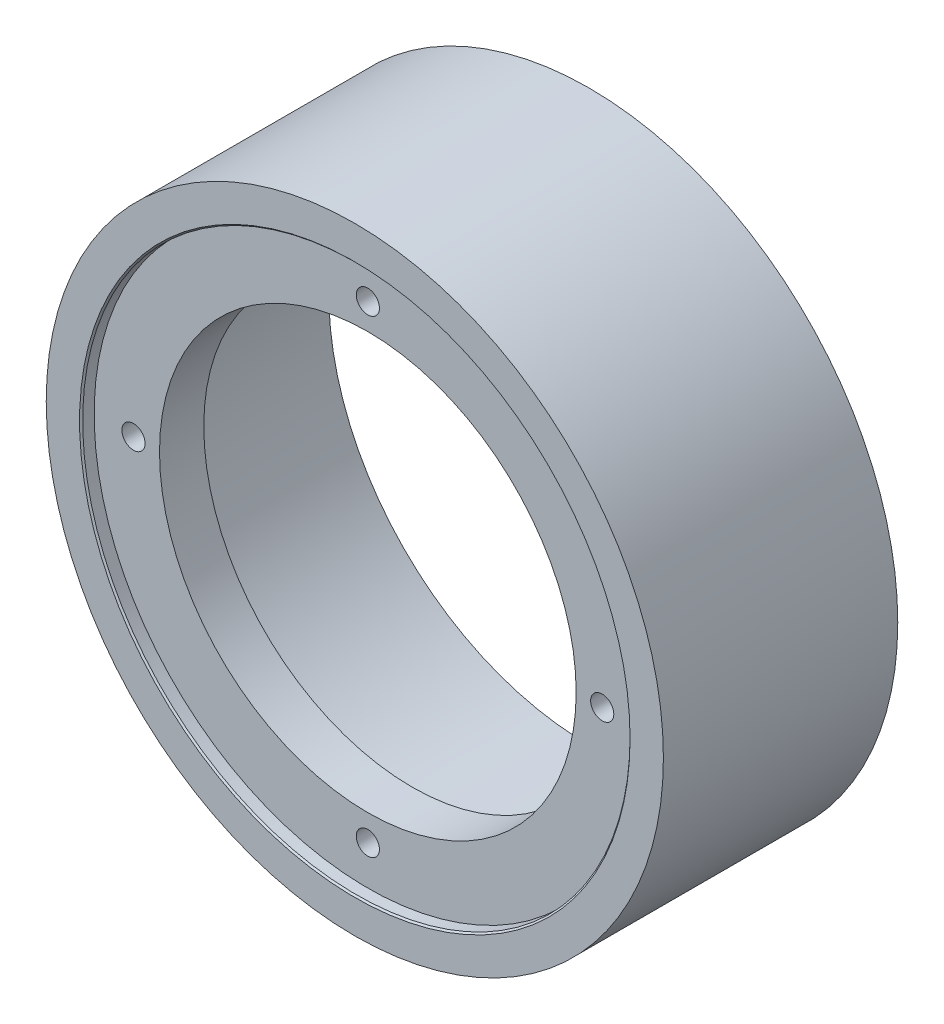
ISO-10303-21;
HEADER;
FILE_DESCRIPTION(('STEP AP214'),'2;1');
FILE_NAME('part.step','',(''),(''),'','','');
FILE_SCHEMA(('AUTOMOTIVE_DESIGN { 1 0 10303 214 1 1 1 1 }'));
ENDSEC;
DATA;
#1=APPLICATION_CONTEXT('core data for automotive mechanical design processes');
#2=APPLICATION_PROTOCOL_DEFINITION('international standard','automotive_design',2000,#1);
#3=PRODUCT_CONTEXT('',#1,'mechanical');
#4=PRODUCT('Part','Part','',(#3));
#5=PRODUCT_RELATED_PRODUCT_CATEGORY('part','',(#4));
#6=PRODUCT_DEFINITION_FORMATION('','',#4);
#7=PRODUCT_DEFINITION_CONTEXT('part definition',#1,'design');
#8=PRODUCT_DEFINITION('design','',#6,#7);
#9=PRODUCT_DEFINITION_SHAPE('','',#8);
#10=(LENGTH_UNIT() NAMED_UNIT(*) SI_UNIT(.MILLI.,.METRE.));
#11=(NAMED_UNIT(*) PLANE_ANGLE_UNIT() SI_UNIT($,.RADIAN.));
#12=(NAMED_UNIT(*) SI_UNIT($,.STERADIAN.) SOLID_ANGLE_UNIT());
#13=UNCERTAINTY_MEASURE_WITH_UNIT(LENGTH_MEASURE(1.E-05),#10,'distance_accuracy_value','');
#14=(GEOMETRIC_REPRESENTATION_CONTEXT(3) GLOBAL_UNCERTAINTY_ASSIGNED_CONTEXT((#13)) GLOBAL_UNIT_ASSIGNED_CONTEXT((#10,
#11,#12)) REPRESENTATION_CONTEXT('',''));
#15=CARTESIAN_POINT('',(0.,0.,0.));
#16=DIRECTION('',(0.,0.,1.));
#17=DIRECTION('',(1.,0.,0.));
#18=AXIS2_PLACEMENT_3D('',#15,#16,#17);
#19=CARTESIAN_POINT('',(0.,0.,17.272));
#20=DIRECTION('',(0.,0.,1.));
#21=DIRECTION('',(1.,0.,0.));
#22=AXIS2_PLACEMENT_3D('',#19,#20,#21);
#23=CYLINDRICAL_SURFACE('',#22,20.32);
#24=CARTESIAN_POINT('',(0.,0.,17.272));
#25=DIRECTION('',(0.,0.,1.));
#26=DIRECTION('',(1.,0.,0.));
#27=AXIS2_PLACEMENT_3D('',#24,#25,#26);
#28=CIRCLE('',#27,20.32);
#29=CARTESIAN_POINT('',(20.32,0.,17.272));
#30=VERTEX_POINT('',#29);
#31=EDGE_CURVE('E51',#30,#30,#28,.T.);
#32=ORIENTED_EDGE('',*,*,#31,.F.);
#33=EDGE_LOOP('',(#32));
#34=FACE_BOUND('',#33,.T.);
#35=CARTESIAN_POINT('',(0.,0.,21.59));
#36=DIRECTION('',(0.,0.,1.));
#37=DIRECTION('',(1.,0.,0.));
#38=AXIS2_PLACEMENT_3D('',#35,#36,#37);
#39=CIRCLE('',#38,20.32);
#40=CARTESIAN_POINT('',(20.32,0.,21.59));
#41=VERTEX_POINT('',#40);
#42=EDGE_CURVE('E48',#41,#41,#39,.F.);
#43=ORIENTED_EDGE('',*,*,#42,.F.);
#44=EDGE_LOOP('',(#43));
#45=FACE_BOUND('',#44,.T.);
#46=ADVANCED_FACE('F30',(#34,#45),#23,.F.);
#47=CARTESIAN_POINT('',(0.,0.,22.86));
#48=DIRECTION('',(0.,0.,-1.));
#49=DIRECTION('',(-1.,0.,0.));
#50=AXIS2_PLACEMENT_3D('',#47,#48,#49);
#51=CYLINDRICAL_SURFACE('',#50,25.4);
#52=CARTESIAN_POINT('',(0.,0.,0.));
#53=DIRECTION('',(0.,0.,1.));
#54=DIRECTION('',(1.,0.,0.));
#55=AXIS2_PLACEMENT_3D('',#52,#53,#54);
#56=CIRCLE('',#55,25.4);
#57=CARTESIAN_POINT('',(25.4,0.,0.));
#58=VERTEX_POINT('',#57);
#59=EDGE_CURVE('E55',#58,#58,#56,.T.);
#60=ORIENTED_EDGE('',*,*,#59,.F.);
#61=EDGE_LOOP('',(#60));
#62=FACE_BOUND('',#61,.T.);
#63=CARTESIAN_POINT('',(0.,0.,17.272));
#64=DIRECTION('',(0.,0.,1.));
#65=DIRECTION('',(1.,0.,0.));
#66=AXIS2_PLACEMENT_3D('',#63,#64,#65);
#67=CIRCLE('',#66,25.4);
#68=CARTESIAN_POINT('',(25.4,0.,17.272));
#69=VERTEX_POINT('',#68);
#70=EDGE_CURVE('E53',#69,#69,#67,.T.);
#71=ORIENTED_EDGE('',*,*,#70,.T.);
#72=EDGE_LOOP('',(#71));
#73=FACE_BOUND('',#72,.T.);
#74=ADVANCED_FACE('F110',(#62,#73),#51,.F.);
#75=CARTESIAN_POINT('',(0.,0.,22.86));
#76=DIRECTION('',(0.,0.,1.));
#77=DIRECTION('',(1.,0.,0.));
#78=AXIS2_PLACEMENT_3D('',#75,#76,#77);
#79=PLANE('',#78);
#80=CARTESIAN_POINT('',(0.,0.,22.86));
#81=DIRECTION('',(0.,0.,1.));
#82=DIRECTION('',(1.,0.,0.));
#83=AXIS2_PLACEMENT_3D('',#80,#81,#82);
#84=CIRCLE('',#83,26.8478);
#85=CARTESIAN_POINT('',(26.8478,0.,22.86));
#86=VERTEX_POINT('',#85);
#87=EDGE_CURVE('E10',#86,#86,#84,.F.);
#88=ORIENTED_EDGE('',*,*,#87,.T.);
#89=EDGE_LOOP('',(#88));
#90=FACE_BOUND('',#89,.T.);
#91=CARTESIAN_POINT('',(0.,0.,22.86));
#92=DIRECTION('',(0.,0.,1.));
#93=DIRECTION('',(1.,0.,0.));
#94=AXIS2_PLACEMENT_3D('',#91,#92,#93);
#95=CIRCLE('',#94,30.099);
#96=CARTESIAN_POINT('',(30.099,0.,22.86));
#97=VERTEX_POINT('',#96);
#98=EDGE_CURVE('E41',#97,#97,#95,.T.);
#99=ORIENTED_EDGE('',*,*,#98,.T.);
#100=EDGE_LOOP('',(#99));
#101=FACE_BOUND('',#100,.T.);
#102=ADVANCED_FACE('F116',(#90,#101),#79,.T.);
#103=CARTESIAN_POINT('',(0.,0.,0.));
#104=DIRECTION('',(0.,0.,1.));
#105=DIRECTION('',(1.,0.,0.));
#106=AXIS2_PLACEMENT_3D('',#103,#104,#105);
#107=PLANE('',#106);
#108=CARTESIAN_POINT('',(0.,0.,0.));
#109=DIRECTION('',(0.,0.,1.));
#110=DIRECTION('',(1.,0.,0.));
#111=AXIS2_PLACEMENT_3D('',#108,#109,#110);
#112=CIRCLE('',#111,30.099);
#113=CARTESIAN_POINT('',(30.099,0.,0.));
#114=VERTEX_POINT('',#113);
#115=EDGE_CURVE('E45',#114,#114,#112,.T.);
#116=ORIENTED_EDGE('',*,*,#115,.F.);
#117=EDGE_LOOP('',(#116));
#118=FACE_BOUND('',#117,.T.);
#119=ORIENTED_EDGE('',*,*,#59,.T.);
#120=EDGE_LOOP('',(#119));
#121=FACE_BOUND('',#120,.T.);
#122=ADVANCED_FACE('F125',(#118,#121),#107,.F.);
#123=CARTESIAN_POINT('',(0.,0.,22.86));
#124=DIRECTION('',(0.,0.,-1.));
#125=DIRECTION('',(-1.,0.,0.));
#126=AXIS2_PLACEMENT_3D('',#123,#124,#125);
#127=CYLINDRICAL_SURFACE('',#126,30.099);
#128=ORIENTED_EDGE('',*,*,#98,.F.);
#129=EDGE_LOOP('',(#128));
#130=FACE_BOUND('',#129,.T.);
#131=ORIENTED_EDGE('',*,*,#115,.T.);
#132=EDGE_LOOP('',(#131));
#133=FACE_BOUND('',#132,.T.);
#134=ADVANCED_FACE('F32',(#130,#133),#127,.T.);
#135=CARTESIAN_POINT('',(0.,0.,17.272));
#136=DIRECTION('',(0.,0.,1.));
#137=DIRECTION('',(1.,0.,0.));
#138=AXIS2_PLACEMENT_3D('',#135,#136,#137);
#139=PLANE('',#138);
#140=CARTESIAN_POINT('',(-22.86,1.45771830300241E-13,17.272));
#141=DIRECTION('',(0.,0.,1.));
#142=DIRECTION('',(1.,0.,0.));
#143=AXIS2_PLACEMENT_3D('',#140,#141,#142);
#144=CIRCLE('',#143,1.13029999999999);
#145=CARTESIAN_POINT('',(-21.7297,1.45771830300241E-13,17.272));
#146=VERTEX_POINT('',#145);
#147=EDGE_CURVE('E83',#146,#146,#144,.T.);
#148=ORIENTED_EDGE('',*,*,#147,.T.);
#149=EDGE_LOOP('',(#148));
#150=FACE_BOUND('',#149,.T.);
#151=CARTESIAN_POINT('',(0.,-22.86,17.272));
#152=DIRECTION('',(0.,0.,1.));
#153=DIRECTION('',(1.,0.,0.));
#154=AXIS2_PLACEMENT_3D('',#151,#152,#153);
#155=CIRCLE('',#154,1.13029999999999);
#156=CARTESIAN_POINT('',(1.13029999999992,-22.86,17.272));
#157=VERTEX_POINT('',#156);
#158=EDGE_CURVE('E77',#157,#157,#155,.T.);
#159=ORIENTED_EDGE('',*,*,#158,.T.);
#160=EDGE_LOOP('',(#159));
#161=FACE_BOUND('',#160,.T.);
#162=CARTESIAN_POINT('',(22.86,0.,17.272));
#163=DIRECTION('',(0.,0.,1.));
#164=DIRECTION('',(1.,0.,0.));
#165=AXIS2_PLACEMENT_3D('',#162,#163,#164);
#166=CIRCLE('',#165,1.13029999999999);
#167=CARTESIAN_POINT('',(23.9903,0.,17.272));
#168=VERTEX_POINT('',#167);
#169=EDGE_CURVE('E71',#168,#168,#166,.T.);
#170=ORIENTED_EDGE('',*,*,#169,.T.);
#171=EDGE_LOOP('',(#170));
#172=FACE_BOUND('',#171,.T.);
#173=CARTESIAN_POINT('',(0.,22.86,17.272));
#174=DIRECTION('',(0.,0.,1.));
#175=DIRECTION('',(1.,0.,0.));
#176=AXIS2_PLACEMENT_3D('',#173,#174,#175);
#177=CIRCLE('',#176,1.13029999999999);
#178=CARTESIAN_POINT('',(1.1302999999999,22.86,17.272));
#179=VERTEX_POINT('',#178);
#180=EDGE_CURVE('E65',#179,#179,#177,.T.);
#181=ORIENTED_EDGE('',*,*,#180,.T.);
#182=EDGE_LOOP('',(#181));
#183=FACE_BOUND('',#182,.T.);
#184=ORIENTED_EDGE('',*,*,#70,.F.);
#185=EDGE_LOOP('',(#184));
#186=FACE_BOUND('',#185,.T.);
#187=ORIENTED_EDGE('',*,*,#31,.T.);
#188=EDGE_LOOP('',(#187));
#189=FACE_BOUND('',#188,.T.);
#190=ADVANCED_FACE('F97',(#150,#161,#172,#183,#186,#189),#139,.F.);
#191=CARTESIAN_POINT('',(0.,0.,21.59));
#192=DIRECTION('',(0.,0.,1.));
#193=DIRECTION('',(1.,0.,0.));
#194=AXIS2_PLACEMENT_3D('',#191,#192,#193);
#195=PLANE('',#194);
#196=CARTESIAN_POINT('',(-22.86,1.45770983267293E-13,21.59));
#197=DIRECTION('',(0.,0.,1.));
#198=DIRECTION('',(1.,0.,0.));
#199=AXIS2_PLACEMENT_3D('',#196,#197,#198);
#200=CIRCLE('',#199,1.13029999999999);
#201=CARTESIAN_POINT('',(-21.7297,1.45770983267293E-13,21.59));
#202=VERTEX_POINT('',#201);
#203=EDGE_CURVE('E86',#202,#202,#200,.T.);
#204=ORIENTED_EDGE('',*,*,#203,.F.);
#205=EDGE_LOOP('',(#204));
#206=FACE_BOUND('',#205,.T.);
#207=CARTESIAN_POINT('',(0.,-22.86,21.59));
#208=DIRECTION('',(0.,0.,1.));
#209=DIRECTION('',(1.,0.,0.));
#210=AXIS2_PLACEMENT_3D('',#207,#208,#209);
#211=CIRCLE('',#210,1.13029999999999);
#212=CARTESIAN_POINT('',(1.13029999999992,-22.86,21.59));
#213=VERTEX_POINT('',#212);
#214=EDGE_CURVE('E80',#213,#213,#211,.T.);
#215=ORIENTED_EDGE('',*,*,#214,.F.);
#216=EDGE_LOOP('',(#215));
#217=FACE_BOUND('',#216,.T.);
#218=CARTESIAN_POINT('',(22.86,0.,21.59));
#219=DIRECTION('',(0.,0.,1.));
#220=DIRECTION('',(1.,0.,0.));
#221=AXIS2_PLACEMENT_3D('',#218,#219,#220);
#222=CIRCLE('',#221,1.13029999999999);
#223=CARTESIAN_POINT('',(23.9903,0.,21.59));
#224=VERTEX_POINT('',#223);
#225=EDGE_CURVE('E74',#224,#224,#222,.T.);
#226=ORIENTED_EDGE('',*,*,#225,.F.);
#227=EDGE_LOOP('',(#226));
#228=FACE_BOUND('',#227,.T.);
#229=CARTESIAN_POINT('',(0.,22.86,21.59));
#230=DIRECTION('',(0.,0.,1.));
#231=DIRECTION('',(1.,0.,0.));
#232=AXIS2_PLACEMENT_3D('',#229,#230,#231);
#233=CIRCLE('',#232,1.13029999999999);
#234=CARTESIAN_POINT('',(1.13029999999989,22.86,21.59));
#235=VERTEX_POINT('',#234);
#236=EDGE_CURVE('E68',#235,#235,#233,.T.);
#237=ORIENTED_EDGE('',*,*,#236,.F.);
#238=EDGE_LOOP('',(#237));
#239=FACE_BOUND('',#238,.T.);
#240=CARTESIAN_POINT('',(0.,0.,21.59));
#241=DIRECTION('',(0.,0.,1.));
#242=DIRECTION('',(1.,0.,0.));
#243=AXIS2_PLACEMENT_3D('',#240,#241,#242);
#244=CIRCLE('',#243,26.6954);
#245=CARTESIAN_POINT('',(26.6954,0.,21.59));
#246=VERTEX_POINT('',#245);
#247=EDGE_CURVE('E52',#246,#246,#244,.T.);
#248=ORIENTED_EDGE('',*,*,#247,.T.);
#249=EDGE_LOOP('',(#248));
#250=FACE_BOUND('',#249,.T.);
#251=ORIENTED_EDGE('',*,*,#42,.T.);
#252=EDGE_LOOP('',(#251));
#253=FACE_BOUND('',#252,.T.);
#254=ADVANCED_FACE('F93',(#206,#217,#228,#239,#250,#253),#195,.T.);
#255=CARTESIAN_POINT('',(0.,0.,21.59));
#256=DIRECTION('',(0.,0.,1.));
#257=DIRECTION('',(1.,0.,0.));
#258=AXIS2_PLACEMENT_3D('',#255,#256,#257);
#259=CYLINDRICAL_SURFACE('',#258,26.6954);
#260=CARTESIAN_POINT('',(0.,0.,22.7076));
#261=DIRECTION('',(0.,0.,1.));
#262=DIRECTION('',(1.,0.,0.));
#263=AXIS2_PLACEMENT_3D('',#260,#261,#262);
#264=CIRCLE('',#263,26.6954);
#265=CARTESIAN_POINT('',(26.6954,0.,22.7076));
#266=VERTEX_POINT('',#265);
#267=EDGE_CURVE('E37',#266,#266,#264,.T.);
#268=ORIENTED_EDGE('',*,*,#267,.T.);
#269=EDGE_LOOP('',(#268));
#270=FACE_BOUND('',#269,.T.);
#271=ORIENTED_EDGE('',*,*,#247,.F.);
#272=EDGE_LOOP('',(#271));
#273=FACE_BOUND('',#272,.T.);
#274=ADVANCED_FACE('F96',(#270,#273),#259,.F.);
#275=CARTESIAN_POINT('',(0.,22.86,21.59));
#276=DIRECTION('',(0.,0.,1.));
#277=DIRECTION('',(1.,0.,0.));
#278=AXIS2_PLACEMENT_3D('',#275,#276,#277);
#279=CYLINDRICAL_SURFACE('',#278,1.13029999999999);
#280=ORIENTED_EDGE('',*,*,#236,.T.);
#281=EDGE_LOOP('',(#280));
#282=FACE_BOUND('',#281,.T.);
#283=ORIENTED_EDGE('',*,*,#180,.F.);
#284=EDGE_LOOP('',(#283));
#285=FACE_BOUND('',#284,.T.);
#286=ADVANCED_FACE('F161',(#282,#285),#279,.F.);
#287=CARTESIAN_POINT('',(22.86,0.,21.59));
#288=DIRECTION('',(0.,0.,1.));
#289=DIRECTION('',(1.,0.,0.));
#290=AXIS2_PLACEMENT_3D('',#287,#288,#289);
#291=CYLINDRICAL_SURFACE('',#290,1.13029999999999);
#292=ORIENTED_EDGE('',*,*,#225,.T.);
#293=EDGE_LOOP('',(#292));
#294=FACE_BOUND('',#293,.T.);
#295=ORIENTED_EDGE('',*,*,#169,.F.);
#296=EDGE_LOOP('',(#295));
#297=FACE_BOUND('',#296,.T.);
#298=ADVANCED_FACE('F168',(#294,#297),#291,.F.);
#299=CARTESIAN_POINT('',(0.,-22.86,21.59));
#300=DIRECTION('',(0.,0.,1.));
#301=DIRECTION('',(1.,0.,0.));
#302=AXIS2_PLACEMENT_3D('',#299,#300,#301);
#303=CYLINDRICAL_SURFACE('',#302,1.13029999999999);
#304=ORIENTED_EDGE('',*,*,#214,.T.);
#305=EDGE_LOOP('',(#304));
#306=FACE_BOUND('',#305,.T.);
#307=ORIENTED_EDGE('',*,*,#158,.F.);
#308=EDGE_LOOP('',(#307));
#309=FACE_BOUND('',#308,.T.);
#310=ADVANCED_FACE('F175',(#306,#309),#303,.F.);
#311=CARTESIAN_POINT('',(-22.86,1.45770983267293E-13,21.59));
#312=DIRECTION('',(0.,0.,1.));
#313=DIRECTION('',(1.,0.,0.));
#314=AXIS2_PLACEMENT_3D('',#311,#312,#313);
#315=CYLINDRICAL_SURFACE('',#314,1.13029999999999);
#316=ORIENTED_EDGE('',*,*,#203,.T.);
#317=EDGE_LOOP('',(#316));
#318=FACE_BOUND('',#317,.T.);
#319=ORIENTED_EDGE('',*,*,#147,.F.);
#320=EDGE_LOOP('',(#319));
#321=FACE_BOUND('',#320,.T.);
#322=ADVANCED_FACE('F90',(#318,#321),#315,.F.);
#323=CARTESIAN_POINT('',(0.,0.,22.7076));
#324=DIRECTION('',(0.,0.,1.));
#325=DIRECTION('',(1.,0.,0.));
#326=AXIS2_PLACEMENT_3D('',#323,#324,#325);
#327=CONICAL_SURFACE('',#326,26.6954,0.785398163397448);
#328=ORIENTED_EDGE('',*,*,#87,.F.);
#329=EDGE_LOOP('',(#328));
#330=FACE_BOUND('',#329,.T.);
#331=ORIENTED_EDGE('',*,*,#267,.F.);
#332=EDGE_LOOP('',(#331));
#333=FACE_BOUND('',#332,.T.);
#334=ADVANCED_FACE('F190',(#330,#333),#327,.F.);
#335=CLOSED_SHELL('',(#46,#74,#102,#122,#134,#190,#254,#274,#286,#298,#310,#322,#334));
#336=MANIFOLD_SOLID_BREP('B2',#335);
#337=ADVANCED_BREP_SHAPE_REPRESENTATION('',(#18,#336),#14);
#338=SHAPE_DEFINITION_REPRESENTATION(#9,#337);
ENDSEC;
END-ISO-10303-21;
